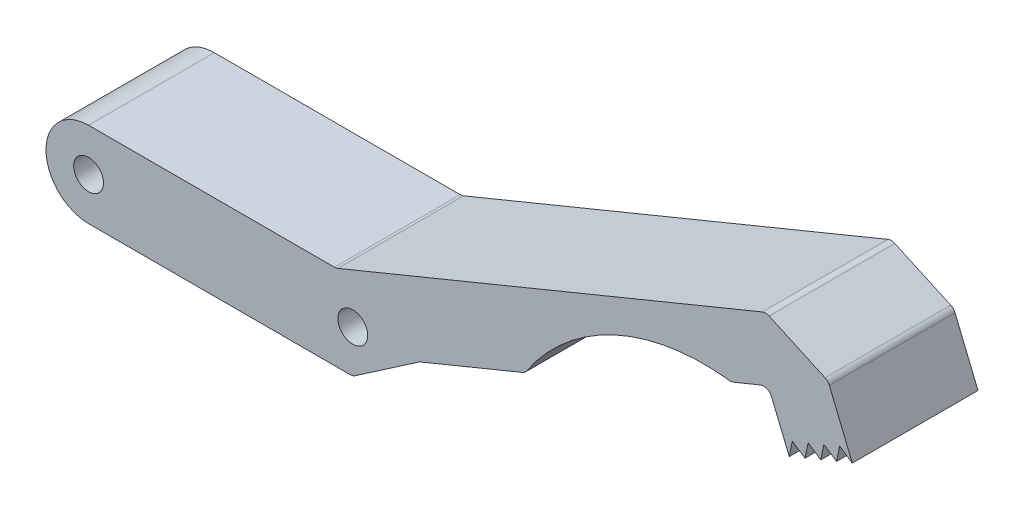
from build123d import *

# Parameters (mm, degrees)
SKETCH_1_R      = 1.75
EXTRUDE_1_DEPTH = 7.375
FILLET_1_R      = 1


with BuildPart() as part:
    # Sketch 1 → Extrude 1 (new, symmetric)
    # profile 1 of 2: a face of its own
    with BuildSketch(Plane.XY):
        with BuildLine():
            Line((20.05, 5), (-9, 5))
            ThreePointArc((-9, 5), (-14, 0), (-9, -5))
            Line((-9, -5), (22, -5))
            Line((22, -5), (29.853914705, 0.381089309))
            Line((29.853914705, 0.381089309), (42.223162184, 5.466701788))
            ThreePointArc((42.223162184, 5.466701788), (52.710898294, 14.550781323), (66.42982236, 16.625445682))
            Line((66.42982236, 16.625445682), (70.761563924, 18.406439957))
            Line((70.761563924, 18.406439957), (72.085078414, 15.187382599))
            Line((72.085078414, 15.187382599), (73.216357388, 12.43588125))
            Line((73.216357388, 12.43588125), (73.575596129, 14.191895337))
            Line((73.575596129, 14.191895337), (75.066113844, 13.196408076))
            Line((75.066113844, 13.196408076), (75.425352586, 14.952422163))
            Line((75.425352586, 14.952422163), (76.915870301, 13.956934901))
            Line((76.915870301, 13.956934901), (77.275109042, 15.712948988))
            Line((77.275109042, 15.712948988), (78.765626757, 14.717461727))
            Line((78.765626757, 14.717461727), (79.124865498, 16.473475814))
            Line((79.124865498, 16.473475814), (80.615383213, 15.477988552))
            Line((80.615383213, 15.477988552), (79.484104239, 18.229489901))
            Line((79.484104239, 18.229489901), (77.772918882, 22.391441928))
            Line((77.772918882, 22.391441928), (70.455863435, 25.724355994))
            Line((70.455863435, 25.724355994), (20.05, 5))
        make_face()
        with Locations((-9, 0)):
            Circle(SKETCH_1_R, mode=Mode.SUBTRACT)
        with Locations((22, 0)):
            Circle(SKETCH_1_R, mode=Mode.SUBTRACT)
    # profile 2 of 2: a face of its own
    with BuildSketch(Plane.XY):
        with BuildLine():
            Line((20.05, 5), (-9, 5))
            ThreePointArc((-9, 5), (-14, 0), (-9, -5))
            Line((-9, -5), (22, -5))
            Line((22, -5), (29.853914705, 0.381089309))
            Line((29.853914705, 0.381089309), (42.223162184, 5.466701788))
            ThreePointArc((42.223162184, 5.466701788), (52.710898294, 14.550781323), (66.42982236, 16.625445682))
            Line((66.42982236, 16.625445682), (70.761563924, 18.406439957))
            Line((70.761563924, 18.406439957), (72.085078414, 15.187382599))
            Line((72.085078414, 15.187382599), (73.216357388, 12.43588125))
            Line((73.216357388, 12.43588125), (73.575596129, 14.191895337))
            Line((73.575596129, 14.191895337), (75.066113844, 13.196408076))
            Line((75.066113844, 13.196408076), (75.425352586, 14.952422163))
            Line((75.425352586, 14.952422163), (76.915870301, 13.956934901))
            Line((76.915870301, 13.956934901), (77.275109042, 15.712948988))
            Line((77.275109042, 15.712948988), (78.765626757, 14.717461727))
            Line((78.765626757, 14.717461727), (79.124865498, 16.473475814))
            Line((79.124865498, 16.473475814), (80.615383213, 15.477988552))
            Line((80.615383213, 15.477988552), (79.484104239, 18.229489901))
            Line((79.484104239, 18.229489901), (77.772918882, 22.391441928))
            Line((77.772918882, 22.391441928), (70.455863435, 25.724355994))
            Line((70.455863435, 25.724355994), (20.05, 5))
        make_face()
        with Locations((-9, 0)):
            Circle(SKETCH_1_R, mode=Mode.SUBTRACT)
        with Locations((22, 0)):
            Circle(SKETCH_1_R, mode=Mode.SUBTRACT)
    extrude(amount=EXTRUDE_1_DEPTH, both=True)

    # Fillet 1
    fillet_1_edges = [part.edges().sort_by_distance(p)[0] for p in [
        (29.853914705, 0.381089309, 0),
        (22, -5, 0),
        (20.05, 5, 0),
        (70.455863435, 25.724355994, 0),
        (77.772918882, 22.391441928, 0),
        (70.761563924, 18.406439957, 0),
        (66.42982236, 16.625445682, 0),
        (42.223162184, 5.466701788, 0),
    ]]
    fillet(fillet_1_edges, radius=FILLET_1_R)


solid = part.part
